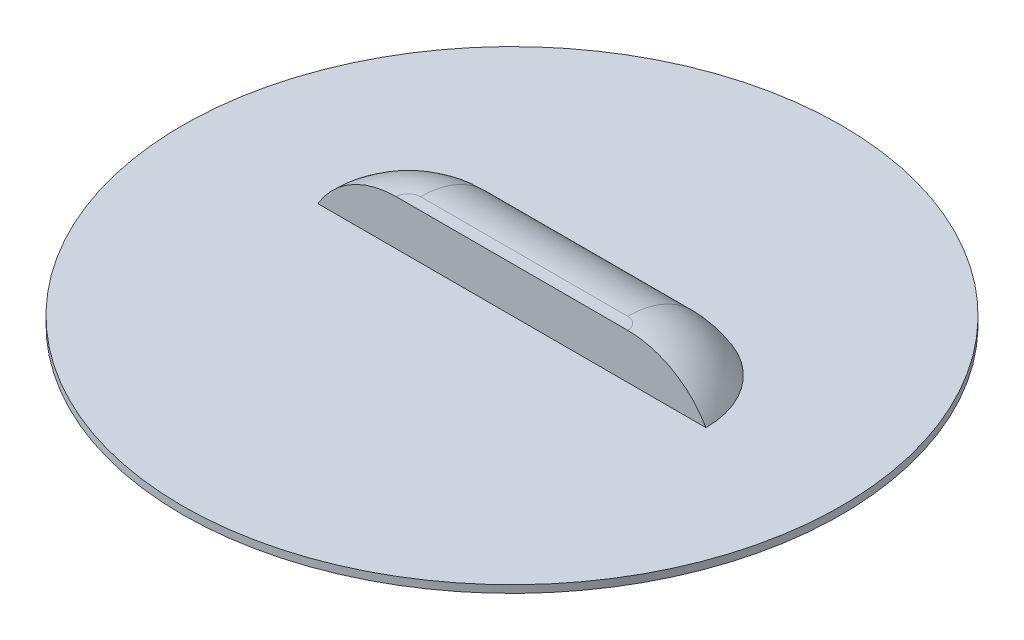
ISO-10303-21;
HEADER;
FILE_DESCRIPTION(('STEP AP214'),'2;1');
FILE_NAME('part.step','',(''),(''),'','','');
FILE_SCHEMA(('AUTOMOTIVE_DESIGN { 1 0 10303 214 1 1 1 1 }'));
ENDSEC;
DATA;
#1=APPLICATION_CONTEXT('core data for automotive mechanical design processes');
#2=APPLICATION_PROTOCOL_DEFINITION('international standard','automotive_design',2000,#1);
#3=PRODUCT_CONTEXT('',#1,'mechanical');
#4=PRODUCT('Part','Part','',(#3));
#5=PRODUCT_RELATED_PRODUCT_CATEGORY('part','',(#4));
#6=PRODUCT_DEFINITION_FORMATION('','',#4);
#7=PRODUCT_DEFINITION_CONTEXT('part definition',#1,'design');
#8=PRODUCT_DEFINITION('design','',#6,#7);
#9=PRODUCT_DEFINITION_SHAPE('','',#8);
#10=(LENGTH_UNIT() NAMED_UNIT(*) SI_UNIT(.MILLI.,.METRE.));
#11=(NAMED_UNIT(*) PLANE_ANGLE_UNIT() SI_UNIT($,.RADIAN.));
#12=(NAMED_UNIT(*) SI_UNIT($,.STERADIAN.) SOLID_ANGLE_UNIT());
#13=UNCERTAINTY_MEASURE_WITH_UNIT(LENGTH_MEASURE(1.E-05),#10,'distance_accuracy_value','');
#14=(GEOMETRIC_REPRESENTATION_CONTEXT(3) GLOBAL_UNCERTAINTY_ASSIGNED_CONTEXT((#13)) GLOBAL_UNIT_ASSIGNED_CONTEXT((#10,
#11,#12)) REPRESENTATION_CONTEXT('',''));
#15=CARTESIAN_POINT('',(0.,0.,0.));
#16=DIRECTION('',(0.,0.,1.));
#17=DIRECTION('',(1.,0.,0.));
#18=AXIS2_PLACEMENT_3D('',#15,#16,#17);
#19=CARTESIAN_POINT('',(-26.1661768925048,7.112,0.00526036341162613));
#20=DIRECTION('',(0.,0.,-1.));
#21=DIRECTION('',(-1.,0.,0.));
#22=AXIS2_PLACEMENT_3D('',#19,#20,#21);
#23=PLANE('',#22);
#24=DIRECTION('',(-1.,0.,0.));
#25=VECTOR('',#24,1.);
#26=CARTESIAN_POINT('',(-26.1661768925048,1.016,0.00526036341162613));
#27=LINE('',#26,#25);
#28=CARTESIAN_POINT('',(26.1620012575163,1.016,0.00526036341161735));
#29=VERTEX_POINT('',#28);
#30=CARTESIAN_POINT('',(-26.1661768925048,1.016,0.00526036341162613));
#31=VERTEX_POINT('',#30);
#32=EDGE_CURVE('E84',#29,#31,#27,.T.);
#33=ORIENTED_EDGE('',*,*,#32,.F.);
#34=CARTESIAN_POINT('',(15.6034195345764,-5.08,0.00526036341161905));
#35=DIRECTION('',(0.,0.,-1.));
#36=DIRECTION('',(-1.,0.,0.));
#37=AXIS2_PLACEMENT_3D('',#34,#35,#36);
#38=CIRCLE('',#37,12.192);
#39=CARTESIAN_POINT('',(15.6034195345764,7.112,0.00526036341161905));
#40=VERTEX_POINT('',#39);
#41=EDGE_CURVE('E11',#29,#40,#38,.F.);
#42=ORIENTED_EDGE('',*,*,#41,.T.);
#43=DIRECTION('',(1.,0.,0.));
#44=VECTOR('',#43,1.);
#45=CARTESIAN_POINT('',(-26.1661768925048,7.112,0.00526036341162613));
#46=LINE('',#45,#44);
#47=CARTESIAN_POINT('',(-15.6075951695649,7.112,0.0052603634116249));
#48=VERTEX_POINT('',#47);
#49=EDGE_CURVE('E111',#48,#40,#46,.T.);
#50=ORIENTED_EDGE('',*,*,#49,.F.);
#51=CARTESIAN_POINT('',(-15.6075951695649,-5.08,0.0052603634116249));
#52=DIRECTION('',(0.,0.,-1.));
#53=DIRECTION('',(-1.,0.,0.));
#54=AXIS2_PLACEMENT_3D('',#51,#52,#53);
#55=CIRCLE('',#54,12.192);
#56=EDGE_CURVE('E48',#48,#31,#55,.F.);
#57=ORIENTED_EDGE('',*,*,#56,.T.);
#58=EDGE_LOOP('',(#33,#42,#50,#57));
#59=FACE_BOUND('',#58,.T.);
#60=ADVANCED_FACE('F39',(#59),#23,.F.);
#61=CARTESIAN_POINT('',(-13.9689165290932,7.112,0.00526036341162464));
#62=DIRECTION('',(0.,-1.,0.));
#63=DIRECTION('',(0.,0.,-1.));
#64=AXIS2_PLACEMENT_3D('',#61,#62,#63);
#65=PLANE('',#64);
#66=ORIENTED_EDGE('',*,*,#49,.T.);
#67=CARTESIAN_POINT('',(13.9647408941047,7.112,0.00526036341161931));
#68=DIRECTION('',(0.,-1.,0.));
#69=DIRECTION('',(0.,0.,-1.));
#70=AXIS2_PLACEMENT_3D('',#67,#68,#69);
#71=CIRCLE('',#70,1.63867864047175);
#72=CARTESIAN_POINT('',(13.9647408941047,7.112,-1.63341827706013));
#73=VERTEX_POINT('',#72);
#74=EDGE_CURVE('E99',#40,#73,#71,.F.);
#75=ORIENTED_EDGE('',*,*,#74,.T.);
#76=DIRECTION('',(-1.,0.,0.));
#77=VECTOR('',#76,1.);
#78=CARTESIAN_POINT('',(-13.9689165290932,7.112,-1.63341827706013));
#79=LINE('',#78,#77);
#80=CARTESIAN_POINT('',(-13.9689165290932,7.112,-1.63341827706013));
#81=VERTEX_POINT('',#80);
#82=EDGE_CURVE('E63',#73,#81,#79,.T.);
#83=ORIENTED_EDGE('',*,*,#82,.T.);
#84=CARTESIAN_POINT('',(-13.9689165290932,7.112,0.00526036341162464));
#85=DIRECTION('',(0.,-1.,0.));
#86=DIRECTION('',(0.,0.,-1.));
#87=AXIS2_PLACEMENT_3D('',#84,#85,#86);
#88=CIRCLE('',#87,1.63867864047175);
#89=EDGE_CURVE('E102',#81,#48,#88,.F.);
#90=ORIENTED_EDGE('',*,*,#89,.T.);
#91=EDGE_LOOP('',(#66,#75,#83,#90));
#92=FACE_BOUND('',#91,.T.);
#93=ADVANCED_FACE('F113',(#92),#65,.F.);
#94=CARTESIAN_POINT('',(13.9647408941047,-5.08,0.00526036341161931));
#95=DIRECTION('',(0.,1.,0.));
#96=DIRECTION('',(0.,0.,1.));
#97=AXIS2_PLACEMENT_3D('',#94,#95,#96);
#98=DEGENERATE_TOROIDAL_SURFACE('',#97,1.63867864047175,12.192,.T.);
#99=ORIENTED_EDGE('',*,*,#41,.F.);
#100=CARTESIAN_POINT('',(13.9647408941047,1.016,0.00526036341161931));
#101=DIRECTION('',(0.,1.,0.));
#102=DIRECTION('',(0.,0.,1.));
#103=AXIS2_PLACEMENT_3D('',#100,#101,#102);
#104=CIRCLE('',#103,12.1972603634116);
#105=CARTESIAN_POINT('',(13.9647408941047,1.016,-12.192));
#106=VERTEX_POINT('',#105);
#107=EDGE_CURVE('E81',#29,#106,#104,.T.);
#108=ORIENTED_EDGE('',*,*,#107,.T.);
#109=CARTESIAN_POINT('',(13.9647408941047,-5.08,-1.63341827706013));
#110=DIRECTION('',(1.,0.,0.));
#111=DIRECTION('',(0.,1.,0.));
#112=AXIS2_PLACEMENT_3D('',#109,#110,#111);
#113=CIRCLE('',#112,12.192);
#114=EDGE_CURVE('E56',#106,#73,#113,.T.);
#115=ORIENTED_EDGE('',*,*,#114,.T.);
#116=ORIENTED_EDGE('',*,*,#74,.F.);
#117=EDGE_LOOP('',(#99,#108,#115,#116));
#118=FACE_BOUND('',#117,.T.);
#119=ADVANCED_FACE('F98',(#118),#98,.T.);
#120=CARTESIAN_POINT('',(-13.9689165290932,-5.08,-1.63341827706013));
#121=DIRECTION('',(-1.,0.,0.));
#122=DIRECTION('',(0.,0.,1.));
#123=AXIS2_PLACEMENT_3D('',#120,#121,#122);
#124=CYLINDRICAL_SURFACE('',#123,12.192);
#125=CARTESIAN_POINT('',(-13.9689165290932,-5.08,-1.63341827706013));
#126=DIRECTION('',(1.,0.,0.));
#127=DIRECTION('',(0.,0.,-1.));
#128=AXIS2_PLACEMENT_3D('',#125,#126,#127);
#129=CIRCLE('',#128,12.192);
#130=CARTESIAN_POINT('',(-13.9689165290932,1.016,-12.192));
#131=VERTEX_POINT('',#130);
#132=EDGE_CURVE('E43',#131,#81,#129,.T.);
#133=ORIENTED_EDGE('',*,*,#132,.T.);
#134=ORIENTED_EDGE('',*,*,#82,.F.);
#135=ORIENTED_EDGE('',*,*,#114,.F.);
#136=DIRECTION('',(-1.,0.,0.));
#137=VECTOR('',#136,1.);
#138=CARTESIAN_POINT('',(-13.9689165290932,1.016,-12.192));
#139=LINE('',#138,#137);
#140=EDGE_CURVE('E87',#106,#131,#139,.T.);
#141=ORIENTED_EDGE('',*,*,#140,.T.);
#142=EDGE_LOOP('',(#133,#134,#135,#141));
#143=FACE_BOUND('',#142,.T.);
#144=ADVANCED_FACE('F114',(#143),#124,.T.);
#145=CARTESIAN_POINT('',(-13.9689165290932,-5.08,0.00526036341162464));
#146=DIRECTION('',(0.,1.,0.));
#147=DIRECTION('',(0.,0.,1.));
#148=AXIS2_PLACEMENT_3D('',#145,#146,#147);
#149=DEGENERATE_TOROIDAL_SURFACE('',#148,1.63867864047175,12.192,.T.);
#150=ORIENTED_EDGE('',*,*,#56,.F.);
#151=ORIENTED_EDGE('',*,*,#89,.F.);
#152=ORIENTED_EDGE('',*,*,#132,.F.);
#153=CARTESIAN_POINT('',(-13.9689165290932,1.016,0.00526036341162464));
#154=DIRECTION('',(0.,1.,0.));
#155=DIRECTION('',(0.,0.,-1.));
#156=AXIS2_PLACEMENT_3D('',#153,#154,#155);
#157=CIRCLE('',#156,12.1972603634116);
#158=EDGE_CURVE('E89',#131,#31,#157,.T.);
#159=ORIENTED_EDGE('',*,*,#158,.T.);
#160=EDGE_LOOP('',(#150,#151,#152,#159));
#161=FACE_BOUND('',#160,.T.);
#162=ADVANCED_FACE('F41',(#161),#149,.T.);
#163=CARTESIAN_POINT('',(0.,1.016,0.));
#164=DIRECTION('',(0.,-1.,0.));
#165=DIRECTION('',(0.,0.,-1.));
#166=AXIS2_PLACEMENT_3D('',#163,#164,#165);
#167=PLANE('',#166);
#168=CARTESIAN_POINT('',(0.,1.016,0.));
#169=DIRECTION('',(0.,-1.,0.));
#170=DIRECTION('',(0.,0.,-1.));
#171=AXIS2_PLACEMENT_3D('',#168,#169,#170);
#172=CIRCLE('',#171,44.45);
#173=CARTESIAN_POINT('',(0.,1.016,-44.45));
#174=VERTEX_POINT('',#173);
#175=EDGE_CURVE('E96',#174,#174,#172,.T.);
#176=ORIENTED_EDGE('',*,*,#175,.F.);
#177=EDGE_LOOP('',(#176));
#178=FACE_BOUND('',#177,.T.);
#179=ORIENTED_EDGE('',*,*,#107,.F.);
#180=ORIENTED_EDGE('',*,*,#32,.T.);
#181=ORIENTED_EDGE('',*,*,#158,.F.);
#182=ORIENTED_EDGE('',*,*,#140,.F.);
#183=EDGE_LOOP('',(#179,#180,#181,#182));
#184=FACE_BOUND('',#183,.T.);
#185=ADVANCED_FACE('F83',(#178,#184),#167,.F.);
#186=CARTESIAN_POINT('',(0.,1.016,0.));
#187=DIRECTION('',(0.,-1.,0.));
#188=DIRECTION('',(0.,0.,-1.));
#189=AXIS2_PLACEMENT_3D('',#186,#187,#188);
#190=CYLINDRICAL_SURFACE('',#189,44.45);
#191=ORIENTED_EDGE('',*,*,#175,.T.);
#192=EDGE_LOOP('',(#191));
#193=FACE_BOUND('',#192,.T.);
#194=CARTESIAN_POINT('',(0.,0.,0.));
#195=DIRECTION('',(0.,-1.,0.));
#196=DIRECTION('',(0.,0.,-1.));
#197=AXIS2_PLACEMENT_3D('',#194,#195,#196);
#198=CIRCLE('',#197,44.45);
#199=CARTESIAN_POINT('',(0.,0.,-44.45));
#200=VERTEX_POINT('',#199);
#201=EDGE_CURVE('E139',#200,#200,#198,.T.);
#202=ORIENTED_EDGE('',*,*,#201,.F.);
#203=EDGE_LOOP('',(#202));
#204=FACE_BOUND('',#203,.T.);
#205=ADVANCED_FACE('F131',(#193,#204),#190,.T.);
#206=CARTESIAN_POINT('',(50.8,0.,38.1));
#207=DIRECTION('',(0.,1.,0.));
#208=DIRECTION('',(0.,0.,1.));
#209=AXIS2_PLACEMENT_3D('',#206,#207,#208);
#210=PLANE('',#209);
#211=ORIENTED_EDGE('',*,*,#201,.T.);
#212=EDGE_LOOP('',(#211));
#213=FACE_BOUND('',#212,.T.);
#214=ADVANCED_FACE('F129',(#213),#210,.F.);
#215=CLOSED_SHELL('',(#60,#93,#119,#144,#162,#185,#205,#214));
#216=MANIFOLD_SOLID_BREP('B2',#215);
#217=ADVANCED_BREP_SHAPE_REPRESENTATION('',(#18,#216),#14);
#218=SHAPE_DEFINITION_REPRESENTATION(#9,#217);
ENDSEC;
END-ISO-10303-21;
